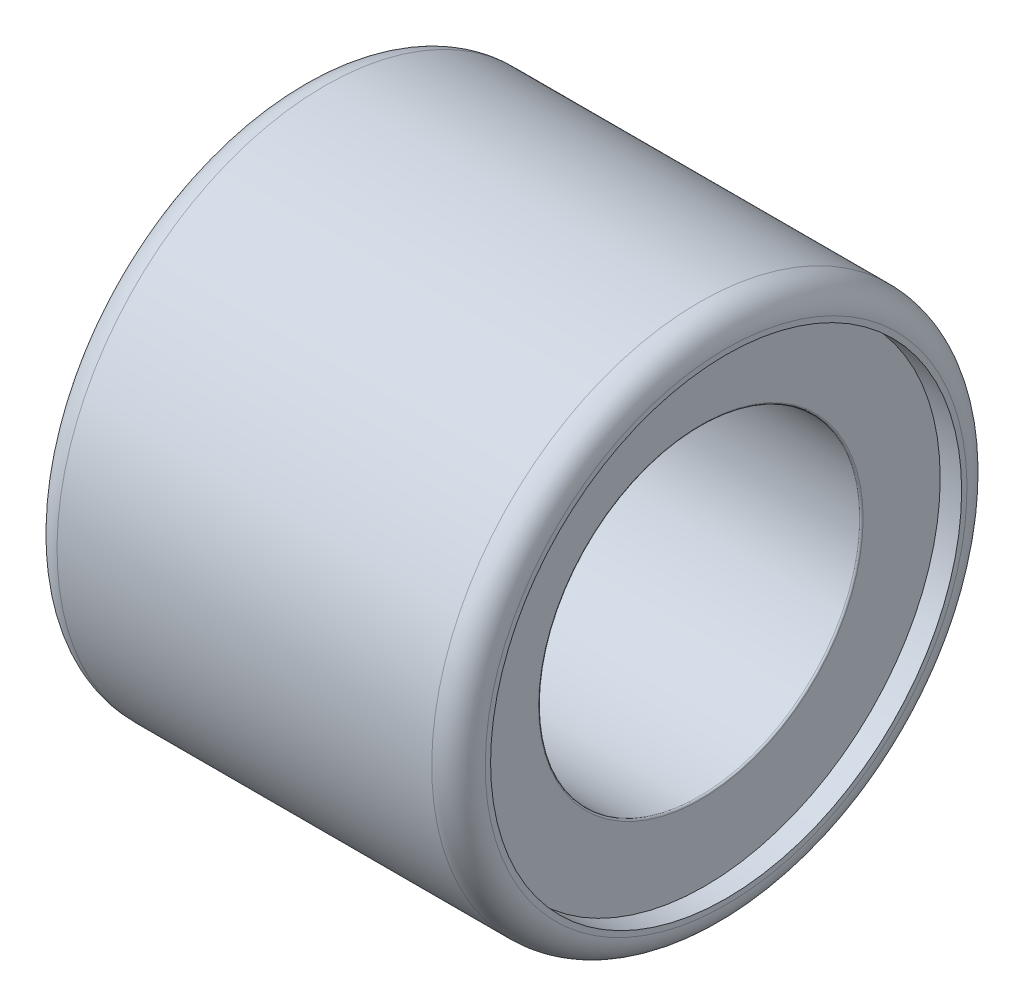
ISO-10303-21;
HEADER;
FILE_DESCRIPTION(('STEP AP214'),'2;1');
FILE_NAME('part.step','',(''),(''),'','','');
FILE_SCHEMA(('AUTOMOTIVE_DESIGN { 1 0 10303 214 1 1 1 1 }'));
ENDSEC;
DATA;
#1=APPLICATION_CONTEXT('core data for automotive mechanical design processes');
#2=APPLICATION_PROTOCOL_DEFINITION('international standard','automotive_design',2000,#1);
#3=PRODUCT_CONTEXT('',#1,'mechanical');
#4=PRODUCT('Part','Part','',(#3));
#5=PRODUCT_RELATED_PRODUCT_CATEGORY('part','',(#4));
#6=PRODUCT_DEFINITION_FORMATION('','',#4);
#7=PRODUCT_DEFINITION_CONTEXT('part definition',#1,'design');
#8=PRODUCT_DEFINITION('design','',#6,#7);
#9=PRODUCT_DEFINITION_SHAPE('','',#8);
#10=(LENGTH_UNIT() NAMED_UNIT(*) SI_UNIT(.MILLI.,.METRE.));
#11=(NAMED_UNIT(*) PLANE_ANGLE_UNIT() SI_UNIT($,.RADIAN.));
#12=(NAMED_UNIT(*) SI_UNIT($,.STERADIAN.) SOLID_ANGLE_UNIT());
#13=UNCERTAINTY_MEASURE_WITH_UNIT(LENGTH_MEASURE(1.E-05),#10,'distance_accuracy_value','');
#14=(GEOMETRIC_REPRESENTATION_CONTEXT(3) GLOBAL_UNCERTAINTY_ASSIGNED_CONTEXT((#13)) GLOBAL_UNIT_ASSIGNED_CONTEXT((#10,
#11,#12)) REPRESENTATION_CONTEXT('',''));
#15=CARTESIAN_POINT('',(0.,0.,0.));
#16=DIRECTION('',(0.,0.,1.));
#17=DIRECTION('',(1.,0.,0.));
#18=AXIS2_PLACEMENT_3D('',#15,#16,#17);
#19=CARTESIAN_POINT('',(-31.75,0.,0.));
#20=DIRECTION('',(1.,0.,0.));
#21=DIRECTION('',(0.,1.,0.));
#22=AXIS2_PLACEMENT_3D('',#19,#20,#21);
#23=CYLINDRICAL_SURFACE('',#22,4.59999999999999);
#24=CARTESIAN_POINT('',(3.6,0.,0.));
#25=DIRECTION('',(1.,0.,0.));
#26=DIRECTION('',(0.,1.,0.));
#27=AXIS2_PLACEMENT_3D('',#24,#25,#26);
#28=CIRCLE('',#27,4.59999999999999);
#29=CARTESIAN_POINT('',(3.6,4.6,0.));
#30=VERTEX_POINT('',#29);
#31=EDGE_CURVE('E66',#30,#30,#28,.T.);
#32=ORIENTED_EDGE('',*,*,#31,.T.);
#33=EDGE_LOOP('',(#32));
#34=FACE_BOUND('',#33,.T.);
#35=CARTESIAN_POINT('',(3.50391977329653,0.,0.));
#36=DIRECTION('',(-1.,0.,0.));
#37=DIRECTION('',(0.,0.,1.));
#38=AXIS2_PLACEMENT_3D('',#35,#36,#37);
#39=CIRCLE('',#38,4.59999999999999);
#40=CARTESIAN_POINT('',(3.50391977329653,0.,4.59999999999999));
#41=VERTEX_POINT('',#40);
#42=EDGE_CURVE('E35',#41,#41,#39,.T.);
#43=ORIENTED_EDGE('',*,*,#42,.T.);
#44=EDGE_LOOP('',(#43));
#45=FACE_BOUND('',#44,.T.);
#46=ADVANCED_FACE('F31',(#34,#45),#23,.F.);
#47=CARTESIAN_POINT('',(-3.6,0.,0.));
#48=DIRECTION('',(1.,0.,0.));
#49=DIRECTION('',(0.,1.,0.));
#50=AXIS2_PLACEMENT_3D('',#47,#48,#49);
#51=CIRCLE('',#50,4.59999999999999);
#52=CARTESIAN_POINT('',(-3.6,4.6,0.));
#53=VERTEX_POINT('',#52);
#54=EDGE_CURVE('E53',#53,#53,#51,.T.);
#55=ORIENTED_EDGE('',*,*,#54,.F.);
#56=EDGE_LOOP('',(#55));
#57=FACE_BOUND('',#56,.T.);
#58=CARTESIAN_POINT('',(-3.50391977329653,0.,0.));
#59=DIRECTION('',(1.,0.,0.));
#60=DIRECTION('',(0.,0.,-1.));
#61=AXIS2_PLACEMENT_3D('',#58,#59,#60);
#62=CIRCLE('',#61,4.59999999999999);
#63=CARTESIAN_POINT('',(-3.50391977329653,0.,-4.59999999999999));
#64=VERTEX_POINT('',#63);
#65=EDGE_CURVE('E47',#64,#64,#62,.T.);
#66=ORIENTED_EDGE('',*,*,#65,.T.);
#67=EDGE_LOOP('',(#66));
#68=FACE_BOUND('',#67,.T.);
#69=ADVANCED_FACE('F101',(#57,#68),#23,.F.);
#70=CARTESIAN_POINT('',(-3.6,4.6,0.));
#71=DIRECTION('',(1.,0.,0.));
#72=DIRECTION('',(0.,1.,0.));
#73=AXIS2_PLACEMENT_3D('',#70,#71,#72);
#74=PLANE('',#73);
#75=ORIENTED_EDGE('',*,*,#54,.T.);
#76=EDGE_LOOP('',(#75));
#77=FACE_BOUND('',#76,.T.);
#78=CARTESIAN_POINT('',(-3.6,0.,0.));
#79=DIRECTION('',(1.,0.,0.));
#80=DIRECTION('',(0.,1.,0.));
#81=AXIS2_PLACEMENT_3D('',#78,#79,#80);
#82=CIRCLE('',#81,4.4);
#83=CARTESIAN_POINT('',(-3.6,4.4,0.));
#84=VERTEX_POINT('',#83);
#85=EDGE_CURVE('E10',#84,#84,#82,.T.);
#86=ORIENTED_EDGE('',*,*,#85,.F.);
#87=EDGE_LOOP('',(#86));
#88=FACE_BOUND('',#87,.T.);
#89=ADVANCED_FACE('F33',(#77,#88),#74,.T.);
#90=CARTESIAN_POINT('',(-31.75,0.,0.));
#91=DIRECTION('',(1.,0.,0.));
#92=DIRECTION('',(0.,1.,0.));
#93=AXIS2_PLACEMENT_3D('',#90,#91,#92);
#94=CYLINDRICAL_SURFACE('',#93,4.4);
#95=ORIENTED_EDGE('',*,*,#85,.T.);
#96=EDGE_LOOP('',(#95));
#97=FACE_BOUND('',#96,.T.);
#98=CARTESIAN_POINT('',(-4.,0.,0.));
#99=DIRECTION('',(1.,0.,0.));
#100=DIRECTION('',(0.,1.,0.));
#101=AXIS2_PLACEMENT_3D('',#98,#99,#100);
#102=CIRCLE('',#101,4.4);
#103=CARTESIAN_POINT('',(-4.,4.4,0.));
#104=VERTEX_POINT('',#103);
#105=EDGE_CURVE('E39',#104,#104,#102,.T.);
#106=ORIENTED_EDGE('',*,*,#105,.F.);
#107=EDGE_LOOP('',(#106));
#108=FACE_BOUND('',#107,.T.);
#109=ADVANCED_FACE('F91',(#97,#108),#94,.F.);
#110=CARTESIAN_POINT('',(-4.,4.4,0.));
#111=DIRECTION('',(-1.,0.,0.));
#112=DIRECTION('',(0.,-1.,0.));
#113=AXIS2_PLACEMENT_3D('',#110,#111,#112);
#114=PLANE('',#113);
#115=ORIENTED_EDGE('',*,*,#105,.T.);
#116=EDGE_LOOP('',(#115));
#117=FACE_BOUND('',#116,.T.);
#118=CARTESIAN_POINT('',(-4.,0.,0.));
#119=DIRECTION('',(1.,0.,0.));
#120=DIRECTION('',(0.,1.,0.));
#121=AXIS2_PLACEMENT_3D('',#118,#119,#120);
#122=CIRCLE('',#121,4.5);
#123=CARTESIAN_POINT('',(-4.,4.5,0.));
#124=VERTEX_POINT('',#123);
#125=EDGE_CURVE('E44',#124,#124,#122,.T.);
#126=ORIENTED_EDGE('',*,*,#125,.F.);
#127=EDGE_LOOP('',(#126));
#128=FACE_BOUND('',#127,.T.);
#129=ADVANCED_FACE('F89',(#117,#128),#114,.T.);
#130=CARTESIAN_POINT('',(-3.5,0.,0.));
#131=DIRECTION('',(1.,0.,0.));
#132=DIRECTION('',(0.,1.,0.));
#133=AXIS2_PLACEMENT_3D('',#130,#131,#132);
#134=TOROIDAL_SURFACE('',#133,4.5,0.5);
#135=ORIENTED_EDGE('',*,*,#125,.T.);
#136=EDGE_LOOP('',(#135));
#137=FACE_BOUND('',#136,.T.);
#138=CARTESIAN_POINT('',(-3.5,0.,0.));
#139=DIRECTION('',(1.,0.,0.));
#140=DIRECTION('',(0.,1.,0.));
#141=AXIS2_PLACEMENT_3D('',#138,#139,#140);
#142=CIRCLE('',#141,4.99999999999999);
#143=CARTESIAN_POINT('',(-3.5,5.,0.));
#144=VERTEX_POINT('',#143);
#145=EDGE_CURVE('E81',#144,#144,#142,.T.);
#146=ORIENTED_EDGE('',*,*,#145,.F.);
#147=EDGE_LOOP('',(#146));
#148=FACE_BOUND('',#147,.T.);
#149=ADVANCED_FACE('F86',(#137,#148),#134,.T.);
#150=CARTESIAN_POINT('',(-31.75,0.,0.));
#151=DIRECTION('',(1.,0.,0.));
#152=DIRECTION('',(0.,1.,0.));
#153=AXIS2_PLACEMENT_3D('',#150,#151,#152);
#154=CYLINDRICAL_SURFACE('',#153,4.99999999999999);
#155=ORIENTED_EDGE('',*,*,#145,.T.);
#156=EDGE_LOOP('',(#155));
#157=FACE_BOUND('',#156,.T.);
#158=CARTESIAN_POINT('',(3.5,0.,0.));
#159=DIRECTION('',(1.,0.,0.));
#160=DIRECTION('',(0.,1.,0.));
#161=AXIS2_PLACEMENT_3D('',#158,#159,#160);
#162=CIRCLE('',#161,4.99999999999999);
#163=CARTESIAN_POINT('',(3.5,5.,0.));
#164=VERTEX_POINT('',#163);
#165=EDGE_CURVE('E78',#164,#164,#162,.T.);
#166=ORIENTED_EDGE('',*,*,#165,.F.);
#167=EDGE_LOOP('',(#166));
#168=FACE_BOUND('',#167,.T.);
#169=ADVANCED_FACE('F98',(#157,#168),#154,.T.);
#170=CARTESIAN_POINT('',(3.5,0.,0.));
#171=DIRECTION('',(1.,0.,0.));
#172=DIRECTION('',(0.,1.,0.));
#173=AXIS2_PLACEMENT_3D('',#170,#171,#172);
#174=TOROIDAL_SURFACE('',#173,4.49999999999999,0.5);
#175=ORIENTED_EDGE('',*,*,#165,.T.);
#176=EDGE_LOOP('',(#175));
#177=FACE_BOUND('',#176,.T.);
#178=CARTESIAN_POINT('',(4.,0.,0.));
#179=DIRECTION('',(1.,0.,0.));
#180=DIRECTION('',(0.,1.,0.));
#181=AXIS2_PLACEMENT_3D('',#178,#179,#180);
#182=CIRCLE('',#181,4.49999999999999);
#183=CARTESIAN_POINT('',(4.,4.5,0.));
#184=VERTEX_POINT('',#183);
#185=EDGE_CURVE('E75',#184,#184,#182,.T.);
#186=ORIENTED_EDGE('',*,*,#185,.F.);
#187=EDGE_LOOP('',(#186));
#188=FACE_BOUND('',#187,.T.);
#189=ADVANCED_FACE('F124',(#177,#188),#174,.T.);
#190=CARTESIAN_POINT('',(4.,4.5,0.));
#191=DIRECTION('',(1.,0.,0.));
#192=DIRECTION('',(0.,1.,0.));
#193=AXIS2_PLACEMENT_3D('',#190,#191,#192);
#194=PLANE('',#193);
#195=ORIENTED_EDGE('',*,*,#185,.T.);
#196=EDGE_LOOP('',(#195));
#197=FACE_BOUND('',#196,.T.);
#198=CARTESIAN_POINT('',(4.,0.,0.));
#199=DIRECTION('',(1.,0.,0.));
#200=DIRECTION('',(0.,1.,0.));
#201=AXIS2_PLACEMENT_3D('',#198,#199,#200);
#202=CIRCLE('',#201,4.39999999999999);
#203=CARTESIAN_POINT('',(4.,4.4,0.));
#204=VERTEX_POINT('',#203);
#205=EDGE_CURVE('E72',#204,#204,#202,.T.);
#206=ORIENTED_EDGE('',*,*,#205,.F.);
#207=EDGE_LOOP('',(#206));
#208=FACE_BOUND('',#207,.T.);
#209=ADVANCED_FACE('F120',(#197,#208),#194,.T.);
#210=CARTESIAN_POINT('',(-31.75,0.,0.));
#211=DIRECTION('',(1.,0.,0.));
#212=DIRECTION('',(0.,1.,0.));
#213=AXIS2_PLACEMENT_3D('',#210,#211,#212);
#214=CYLINDRICAL_SURFACE('',#213,4.39999999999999);
#215=ORIENTED_EDGE('',*,*,#205,.T.);
#216=EDGE_LOOP('',(#215));
#217=FACE_BOUND('',#216,.T.);
#218=CARTESIAN_POINT('',(3.6,0.,0.));
#219=DIRECTION('',(1.,0.,0.));
#220=DIRECTION('',(0.,1.,0.));
#221=AXIS2_PLACEMENT_3D('',#218,#219,#220);
#222=CIRCLE('',#221,4.39999999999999);
#223=CARTESIAN_POINT('',(3.6,4.4,0.));
#224=VERTEX_POINT('',#223);
#225=EDGE_CURVE('E69',#224,#224,#222,.T.);
#226=ORIENTED_EDGE('',*,*,#225,.F.);
#227=EDGE_LOOP('',(#226));
#228=FACE_BOUND('',#227,.T.);
#229=ADVANCED_FACE('F116',(#217,#228),#214,.F.);
#230=CARTESIAN_POINT('',(3.6,4.4,0.));
#231=DIRECTION('',(-1.,0.,0.));
#232=DIRECTION('',(0.,-1.,0.));
#233=AXIS2_PLACEMENT_3D('',#230,#231,#232);
#234=PLANE('',#233);
#235=ORIENTED_EDGE('',*,*,#225,.T.);
#236=EDGE_LOOP('',(#235));
#237=FACE_BOUND('',#236,.T.);
#238=ORIENTED_EDGE('',*,*,#31,.F.);
#239=EDGE_LOOP('',(#238));
#240=FACE_BOUND('',#239,.T.);
#241=ADVANCED_FACE('F113',(#237,#240),#234,.T.);
#242=CARTESIAN_POINT('',(-3.49598,0.,0.));
#243=DIRECTION('',(-1.,0.,0.));
#244=DIRECTION('',(0.,0.,1.));
#245=AXIS2_PLACEMENT_3D('',#242,#243,#244);
#246=TOROIDAL_SURFACE('',#245,3.03202,0.0320199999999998);
#247=CARTESIAN_POINT('',(-3.49598,0.,0.));
#248=DIRECTION('',(-1.,0.,0.));
#249=DIRECTION('',(0.,0.,1.));
#250=AXIS2_PLACEMENT_3D('',#247,#248,#249);
#251=CIRCLE('',#250,3.);
#252=CARTESIAN_POINT('',(-3.49598,0.,3.));
#253=VERTEX_POINT('',#252);
#254=EDGE_CURVE('E49',#253,#253,#251,.T.);
#255=ORIENTED_EDGE('',*,*,#254,.F.);
#256=EDGE_LOOP('',(#255));
#257=FACE_BOUND('',#256,.T.);
#258=CARTESIAN_POINT('',(-3.528,0.,0.));
#259=DIRECTION('',(-1.,0.,0.));
#260=DIRECTION('',(0.,0.,1.));
#261=AXIS2_PLACEMENT_3D('',#258,#259,#260);
#262=CIRCLE('',#261,3.03202);
#263=CARTESIAN_POINT('',(-3.528,0.,3.03202));
#264=VERTEX_POINT('',#263);
#265=EDGE_CURVE('E278',#264,#264,#262,.T.);
#266=ORIENTED_EDGE('',*,*,#265,.T.);
#267=EDGE_LOOP('',(#266));
#268=FACE_BOUND('',#267,.T.);
#269=ADVANCED_FACE('F111',(#257,#268),#246,.T.);
#270=CARTESIAN_POINT('',(-25.4,0.,0.));
#271=DIRECTION('',(-1.,0.,0.));
#272=DIRECTION('',(0.,0.,1.));
#273=AXIS2_PLACEMENT_3D('',#270,#271,#272);
#274=CYLINDRICAL_SURFACE('',#273,3.);
#275=CARTESIAN_POINT('',(3.49598,0.,0.));
#276=DIRECTION('',(-1.,0.,0.));
#277=DIRECTION('',(0.,0.,1.));
#278=AXIS2_PLACEMENT_3D('',#275,#276,#277);
#279=CIRCLE('',#278,3.);
#280=CARTESIAN_POINT('',(3.49598,0.,3.));
#281=VERTEX_POINT('',#280);
#282=EDGE_CURVE('E55',#281,#281,#279,.T.);
#283=ORIENTED_EDGE('',*,*,#282,.F.);
#284=EDGE_LOOP('',(#283));
#285=FACE_BOUND('',#284,.T.);
#286=ORIENTED_EDGE('',*,*,#254,.T.);
#287=EDGE_LOOP('',(#286));
#288=FACE_BOUND('',#287,.T.);
#289=ADVANCED_FACE('F168',(#285,#288),#274,.F.);
#290=CARTESIAN_POINT('',(3.49598,0.,0.));
#291=DIRECTION('',(-1.,0.,0.));
#292=DIRECTION('',(0.,0.,1.));
#293=AXIS2_PLACEMENT_3D('',#290,#291,#292);
#294=TOROIDAL_SURFACE('',#293,3.03202,0.03202);
#295=CARTESIAN_POINT('',(3.528,0.,0.));
#296=DIRECTION('',(-1.,0.,0.));
#297=DIRECTION('',(0.,0.,1.));
#298=AXIS2_PLACEMENT_3D('',#295,#296,#297);
#299=CIRCLE('',#298,3.03202);
#300=CARTESIAN_POINT('',(3.528,0.,3.03202));
#301=VERTEX_POINT('',#300);
#302=EDGE_CURVE('E60',#301,#301,#299,.T.);
#303=ORIENTED_EDGE('',*,*,#302,.F.);
#304=EDGE_LOOP('',(#303));
#305=FACE_BOUND('',#304,.T.);
#306=ORIENTED_EDGE('',*,*,#282,.T.);
#307=EDGE_LOOP('',(#306));
#308=FACE_BOUND('',#307,.T.);
#309=ADVANCED_FACE('F176',(#305,#308),#294,.T.);
#310=CARTESIAN_POINT('',(3.528,4.56898,0.));
#311=DIRECTION('',(-1.,0.,0.));
#312=DIRECTION('',(0.,0.,1.));
#313=AXIS2_PLACEMENT_3D('',#310,#311,#312);
#314=PLANE('',#313);
#315=CARTESIAN_POINT('',(3.528,0.,0.));
#316=DIRECTION('',(-1.,0.,0.));
#317=DIRECTION('',(0.,0.,1.));
#318=AXIS2_PLACEMENT_3D('',#315,#316,#317);
#319=CIRCLE('',#318,4.56898);
#320=CARTESIAN_POINT('',(3.528,0.,4.56898));
#321=VERTEX_POINT('',#320);
#322=EDGE_CURVE('E283',#321,#321,#319,.T.);
#323=ORIENTED_EDGE('',*,*,#322,.F.);
#324=EDGE_LOOP('',(#323));
#325=FACE_BOUND('',#324,.T.);
#326=ORIENTED_EDGE('',*,*,#302,.T.);
#327=EDGE_LOOP('',(#326));
#328=FACE_BOUND('',#327,.T.);
#329=ADVANCED_FACE('F183',(#325,#328),#314,.F.);
#330=CARTESIAN_POINT('',(3.49598,0.,0.));
#331=DIRECTION('',(-1.,0.,0.));
#332=DIRECTION('',(0.,0.,1.));
#333=AXIS2_PLACEMENT_3D('',#330,#331,#332);
#334=TOROIDAL_SURFACE('',#333,4.56898,0.0320200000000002);
#335=ORIENTED_EDGE('',*,*,#42,.F.);
#336=EDGE_LOOP('',(#335));
#337=FACE_BOUND('',#336,.T.);
#338=ORIENTED_EDGE('',*,*,#322,.T.);
#339=EDGE_LOOP('',(#338));
#340=FACE_BOUND('',#339,.T.);
#341=ADVANCED_FACE('F191',(#337,#340),#334,.T.);
#342=CARTESIAN_POINT('',(-3.49598,0.,0.));
#343=DIRECTION('',(-1.,0.,0.));
#344=DIRECTION('',(0.,0.,1.));
#345=AXIS2_PLACEMENT_3D('',#342,#343,#344);
#346=TOROIDAL_SURFACE('',#345,4.56898,0.0320199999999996);
#347=ORIENTED_EDGE('',*,*,#65,.F.);
#348=EDGE_LOOP('',(#347));
#349=FACE_BOUND('',#348,.T.);
#350=CARTESIAN_POINT('',(-3.528,0.,0.));
#351=DIRECTION('',(-1.,0.,0.));
#352=DIRECTION('',(0.,0.,1.));
#353=AXIS2_PLACEMENT_3D('',#350,#351,#352);
#354=CIRCLE('',#353,4.56898);
#355=CARTESIAN_POINT('',(-3.528,0.,4.56898));
#356=VERTEX_POINT('',#355);
#357=EDGE_CURVE('E281',#356,#356,#354,.T.);
#358=ORIENTED_EDGE('',*,*,#357,.F.);
#359=EDGE_LOOP('',(#358));
#360=FACE_BOUND('',#359,.T.);
#361=ADVANCED_FACE('F199',(#349,#360),#346,.T.);
#362=CARTESIAN_POINT('',(-3.528,4.56898,0.));
#363=DIRECTION('',(1.,0.,0.));
#364=DIRECTION('',(0.,0.,-1.));
#365=AXIS2_PLACEMENT_3D('',#362,#363,#364);
#366=PLANE('',#365);
#367=ORIENTED_EDGE('',*,*,#265,.F.);
#368=EDGE_LOOP('',(#367));
#369=FACE_BOUND('',#368,.T.);
#370=ORIENTED_EDGE('',*,*,#357,.T.);
#371=EDGE_LOOP('',(#370));
#372=FACE_BOUND('',#371,.T.);
#373=ADVANCED_FACE('F207',(#369,#372),#366,.F.);
#374=CLOSED_SHELL('',(#46,#69,#89,#109,#129,#149,#169,#189,#209,#229,#241,#269,#289,#309,#329,
#341,#361,#373));
#375=MANIFOLD_SOLID_BREP('B2',#374);
#376=ADVANCED_BREP_SHAPE_REPRESENTATION('',(#18,#375),#14);
#377=SHAPE_DEFINITION_REPRESENTATION(#9,#376);
ENDSEC;
END-ISO-10303-21;
